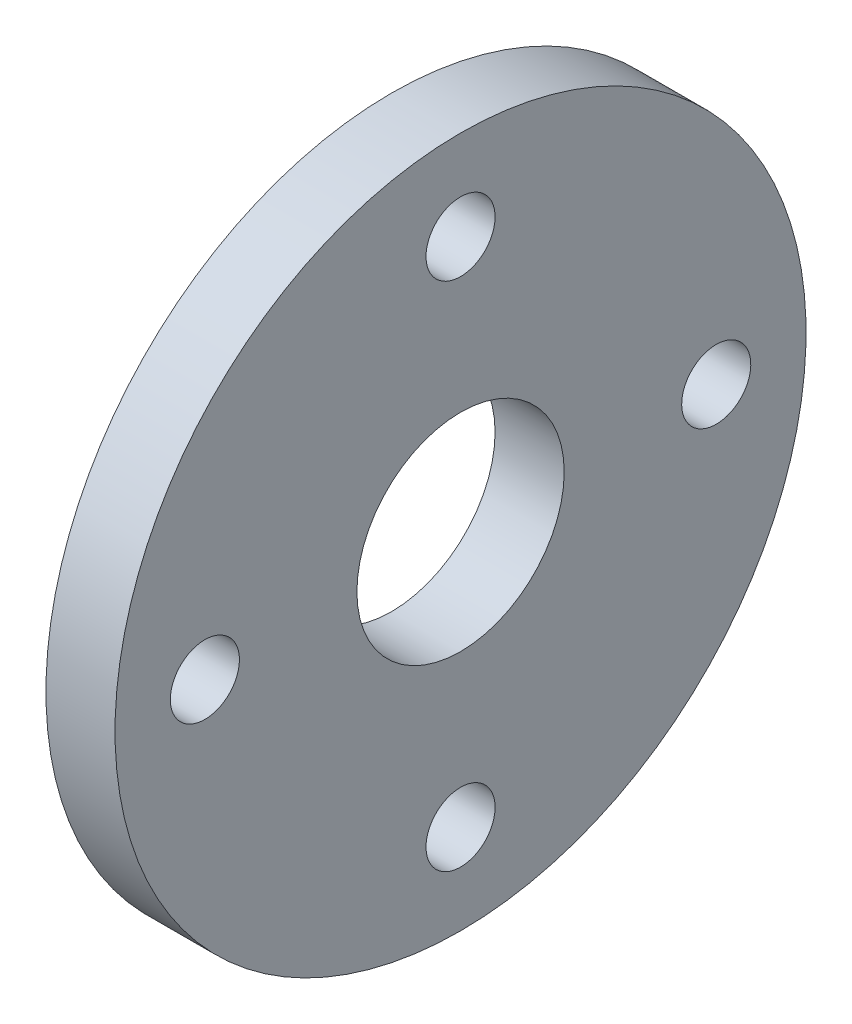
ISO-10303-21;
HEADER;
FILE_DESCRIPTION(('STEP AP214'),'2;1');
FILE_NAME('part.step','',(''),(''),'','','');
FILE_SCHEMA(('AUTOMOTIVE_DESIGN { 1 0 10303 214 1 1 1 1 }'));
ENDSEC;
DATA;
#1=APPLICATION_CONTEXT('core data for automotive mechanical design processes');
#2=APPLICATION_PROTOCOL_DEFINITION('international standard','automotive_design',2000,#1);
#3=PRODUCT_CONTEXT('',#1,'mechanical');
#4=PRODUCT('Part','Part','',(#3));
#5=PRODUCT_RELATED_PRODUCT_CATEGORY('part','',(#4));
#6=PRODUCT_DEFINITION_FORMATION('','',#4);
#7=PRODUCT_DEFINITION_CONTEXT('part definition',#1,'design');
#8=PRODUCT_DEFINITION('design','',#6,#7);
#9=PRODUCT_DEFINITION_SHAPE('','',#8);
#10=(LENGTH_UNIT() NAMED_UNIT(*) SI_UNIT(.MILLI.,.METRE.));
#11=(NAMED_UNIT(*) PLANE_ANGLE_UNIT() SI_UNIT($,.RADIAN.));
#12=(NAMED_UNIT(*) SI_UNIT($,.STERADIAN.) SOLID_ANGLE_UNIT());
#13=UNCERTAINTY_MEASURE_WITH_UNIT(LENGTH_MEASURE(1.E-05),#10,'distance_accuracy_value','');
#14=(GEOMETRIC_REPRESENTATION_CONTEXT(3) GLOBAL_UNCERTAINTY_ASSIGNED_CONTEXT((#13)) GLOBAL_UNIT_ASSIGNED_CONTEXT((#10,
#11,#12)) REPRESENTATION_CONTEXT('',''));
#15=CARTESIAN_POINT('',(0.,0.,0.));
#16=DIRECTION('',(0.,0.,1.));
#17=DIRECTION('',(1.,0.,0.));
#18=AXIS2_PLACEMENT_3D('',#15,#16,#17);
#19=CARTESIAN_POINT('',(192.5,139.,0.));
#20=DIRECTION('',(1.,0.,0.));
#21=DIRECTION('',(0.,1.,0.));
#22=AXIS2_PLACEMENT_3D('',#19,#20,#21);
#23=PLANE('',#22);
#24=CARTESIAN_POINT('',(192.5,102.,0.));
#25=DIRECTION('',(1.,0.,0.));
#26=DIRECTION('',(0.,1.,0.));
#27=AXIS2_PLACEMENT_3D('',#24,#25,#26);
#28=CIRCLE('',#27,5.);
#29=CARTESIAN_POINT('',(192.5,107.,0.));
#30=VERTEX_POINT('',#29);
#31=EDGE_CURVE('E78',#30,#30,#28,.T.);
#32=ORIENTED_EDGE('',*,*,#31,.F.);
#33=EDGE_LOOP('',(#32));
#34=FACE_BOUND('',#33,.T.);
#35=CARTESIAN_POINT('',(192.5,176.,0.));
#36=DIRECTION('',(1.,0.,0.));
#37=DIRECTION('',(0.,1.,0.));
#38=AXIS2_PLACEMENT_3D('',#35,#36,#37);
#39=CIRCLE('',#38,5.);
#40=CARTESIAN_POINT('',(192.5,181.,0.));
#41=VERTEX_POINT('',#40);
#42=EDGE_CURVE('E62',#41,#41,#39,.T.);
#43=ORIENTED_EDGE('',*,*,#42,.F.);
#44=EDGE_LOOP('',(#43));
#45=FACE_BOUND('',#44,.T.);
#46=CARTESIAN_POINT('',(192.5,139.,0.));
#47=DIRECTION('',(1.,0.,0.));
#48=DIRECTION('',(0.,1.,0.));
#49=AXIS2_PLACEMENT_3D('',#46,#47,#48);
#50=CIRCLE('',#49,50.);
#51=CARTESIAN_POINT('',(192.5,189.,0.));
#52=VERTEX_POINT('',#51);
#53=EDGE_CURVE('E10',#52,#52,#50,.T.);
#54=ORIENTED_EDGE('',*,*,#53,.T.);
#55=EDGE_LOOP('',(#54));
#56=FACE_BOUND('',#55,.T.);
#57=CARTESIAN_POINT('',(192.5,139.,37.));
#58=DIRECTION('',(1.,0.,0.));
#59=DIRECTION('',(0.,1.,0.));
#60=AXIS2_PLACEMENT_3D('',#57,#58,#59);
#61=CIRCLE('',#60,5.);
#62=CARTESIAN_POINT('',(192.5,144.,37.));
#63=VERTEX_POINT('',#62);
#64=EDGE_CURVE('E56',#63,#63,#61,.T.);
#65=ORIENTED_EDGE('',*,*,#64,.F.);
#66=EDGE_LOOP('',(#65));
#67=FACE_BOUND('',#66,.T.);
#68=CARTESIAN_POINT('',(192.5,139.,-37.));
#69=DIRECTION('',(1.,0.,0.));
#70=DIRECTION('',(0.,1.,0.));
#71=AXIS2_PLACEMENT_3D('',#68,#69,#70);
#72=CIRCLE('',#71,5.);
#73=CARTESIAN_POINT('',(192.5,144.,-37.));
#74=VERTEX_POINT('',#73);
#75=EDGE_CURVE('E70',#74,#74,#72,.T.);
#76=ORIENTED_EDGE('',*,*,#75,.F.);
#77=EDGE_LOOP('',(#76));
#78=FACE_BOUND('',#77,.T.);
#79=CARTESIAN_POINT('',(192.5,139.,0.));
#80=DIRECTION('',(1.,0.,0.));
#81=DIRECTION('',(0.,1.,0.));
#82=AXIS2_PLACEMENT_3D('',#79,#80,#81);
#83=CIRCLE('',#82,15.);
#84=CARTESIAN_POINT('',(192.5,154.,0.));
#85=VERTEX_POINT('',#84);
#86=EDGE_CURVE('E86',#85,#85,#83,.T.);
#87=ORIENTED_EDGE('',*,*,#86,.F.);
#88=EDGE_LOOP('',(#87));
#89=FACE_BOUND('',#88,.T.);
#90=ADVANCED_FACE('F43',(#34,#45,#56,#67,#78,#89),#23,.T.);
#91=CARTESIAN_POINT('',(182.5,139.,0.));
#92=DIRECTION('',(1.,0.,0.));
#93=DIRECTION('',(0.,1.,0.));
#94=AXIS2_PLACEMENT_3D('',#91,#92,#93);
#95=PLANE('',#94);
#96=CARTESIAN_POINT('',(182.5,139.,0.));
#97=DIRECTION('',(1.,0.,0.));
#98=DIRECTION('',(0.,1.,0.));
#99=AXIS2_PLACEMENT_3D('',#96,#97,#98);
#100=CIRCLE('',#99,50.);
#101=CARTESIAN_POINT('',(182.5,189.,0.));
#102=VERTEX_POINT('',#101);
#103=EDGE_CURVE('E47',#102,#102,#100,.T.);
#104=ORIENTED_EDGE('',*,*,#103,.F.);
#105=EDGE_LOOP('',(#104));
#106=FACE_BOUND('',#105,.T.);
#107=CARTESIAN_POINT('',(182.5,139.,37.));
#108=DIRECTION('',(1.,0.,0.));
#109=DIRECTION('',(0.,1.,0.));
#110=AXIS2_PLACEMENT_3D('',#107,#108,#109);
#111=CIRCLE('',#110,5.);
#112=CARTESIAN_POINT('',(182.5,144.,37.));
#113=VERTEX_POINT('',#112);
#114=EDGE_CURVE('E58',#113,#113,#111,.T.);
#115=ORIENTED_EDGE('',*,*,#114,.T.);
#116=EDGE_LOOP('',(#115));
#117=FACE_BOUND('',#116,.T.);
#118=CARTESIAN_POINT('',(182.5,176.,0.));
#119=DIRECTION('',(1.,0.,0.));
#120=DIRECTION('',(0.,1.,0.));
#121=AXIS2_PLACEMENT_3D('',#118,#119,#120);
#122=CIRCLE('',#121,5.);
#123=CARTESIAN_POINT('',(182.5,181.,0.));
#124=VERTEX_POINT('',#123);
#125=EDGE_CURVE('E66',#124,#124,#122,.T.);
#126=ORIENTED_EDGE('',*,*,#125,.T.);
#127=EDGE_LOOP('',(#126));
#128=FACE_BOUND('',#127,.T.);
#129=CARTESIAN_POINT('',(182.5,139.,-37.));
#130=DIRECTION('',(1.,0.,0.));
#131=DIRECTION('',(0.,1.,0.));
#132=AXIS2_PLACEMENT_3D('',#129,#130,#131);
#133=CIRCLE('',#132,5.);
#134=CARTESIAN_POINT('',(182.5,144.,-37.));
#135=VERTEX_POINT('',#134);
#136=EDGE_CURVE('E74',#135,#135,#133,.T.);
#137=ORIENTED_EDGE('',*,*,#136,.T.);
#138=EDGE_LOOP('',(#137));
#139=FACE_BOUND('',#138,.T.);
#140=CARTESIAN_POINT('',(182.5,102.,0.));
#141=DIRECTION('',(1.,0.,0.));
#142=DIRECTION('',(0.,1.,0.));
#143=AXIS2_PLACEMENT_3D('',#140,#141,#142);
#144=CIRCLE('',#143,5.);
#145=CARTESIAN_POINT('',(182.5,107.,0.));
#146=VERTEX_POINT('',#145);
#147=EDGE_CURVE('E82',#146,#146,#144,.T.);
#148=ORIENTED_EDGE('',*,*,#147,.T.);
#149=EDGE_LOOP('',(#148));
#150=FACE_BOUND('',#149,.T.);
#151=CARTESIAN_POINT('',(182.5,139.,0.));
#152=DIRECTION('',(1.,0.,0.));
#153=DIRECTION('',(0.,1.,0.));
#154=AXIS2_PLACEMENT_3D('',#151,#152,#153);
#155=CIRCLE('',#154,15.);
#156=CARTESIAN_POINT('',(182.5,154.,0.));
#157=VERTEX_POINT('',#156);
#158=EDGE_CURVE('E90',#157,#157,#155,.T.);
#159=ORIENTED_EDGE('',*,*,#158,.T.);
#160=EDGE_LOOP('',(#159));
#161=FACE_BOUND('',#160,.T.);
#162=ADVANCED_FACE('F102',(#106,#117,#128,#139,#150,#161),#95,.F.);
#163=CARTESIAN_POINT('',(192.5,139.,0.));
#164=DIRECTION('',(-1.,0.,0.));
#165=DIRECTION('',(0.,-1.,0.));
#166=AXIS2_PLACEMENT_3D('',#163,#164,#165);
#167=CYLINDRICAL_SURFACE('',#166,50.);
#168=ORIENTED_EDGE('',*,*,#53,.F.);
#169=EDGE_LOOP('',(#168));
#170=FACE_BOUND('',#169,.T.);
#171=ORIENTED_EDGE('',*,*,#103,.T.);
#172=EDGE_LOOP('',(#171));
#173=FACE_BOUND('',#172,.T.);
#174=ADVANCED_FACE('F45',(#170,#173),#167,.T.);
#175=CARTESIAN_POINT('',(192.5,139.,37.));
#176=DIRECTION('',(-1.,0.,0.));
#177=DIRECTION('',(0.,-1.,0.));
#178=AXIS2_PLACEMENT_3D('',#175,#176,#177);
#179=CYLINDRICAL_SURFACE('',#178,5.);
#180=ORIENTED_EDGE('',*,*,#64,.T.);
#181=EDGE_LOOP('',(#180));
#182=FACE_BOUND('',#181,.T.);
#183=ORIENTED_EDGE('',*,*,#114,.F.);
#184=EDGE_LOOP('',(#183));
#185=FACE_BOUND('',#184,.T.);
#186=ADVANCED_FACE('F112',(#182,#185),#179,.F.);
#187=CARTESIAN_POINT('',(192.5,176.,0.));
#188=DIRECTION('',(-1.,0.,0.));
#189=DIRECTION('',(0.,-1.,0.));
#190=AXIS2_PLACEMENT_3D('',#187,#188,#189);
#191=CYLINDRICAL_SURFACE('',#190,5.);
#192=ORIENTED_EDGE('',*,*,#42,.T.);
#193=EDGE_LOOP('',(#192));
#194=FACE_BOUND('',#193,.T.);
#195=ORIENTED_EDGE('',*,*,#125,.F.);
#196=EDGE_LOOP('',(#195));
#197=FACE_BOUND('',#196,.T.);
#198=ADVANCED_FACE('F115',(#194,#197),#191,.F.);
#199=CARTESIAN_POINT('',(192.5,139.,-37.));
#200=DIRECTION('',(-1.,0.,0.));
#201=DIRECTION('',(0.,-1.,0.));
#202=AXIS2_PLACEMENT_3D('',#199,#200,#201);
#203=CYLINDRICAL_SURFACE('',#202,5.);
#204=ORIENTED_EDGE('',*,*,#75,.T.);
#205=EDGE_LOOP('',(#204));
#206=FACE_BOUND('',#205,.T.);
#207=ORIENTED_EDGE('',*,*,#136,.F.);
#208=EDGE_LOOP('',(#207));
#209=FACE_BOUND('',#208,.T.);
#210=ADVANCED_FACE('F119',(#206,#209),#203,.F.);
#211=CARTESIAN_POINT('',(192.5,102.,0.));
#212=DIRECTION('',(-1.,0.,0.));
#213=DIRECTION('',(0.,-1.,0.));
#214=AXIS2_PLACEMENT_3D('',#211,#212,#213);
#215=CYLINDRICAL_SURFACE('',#214,5.);
#216=ORIENTED_EDGE('',*,*,#31,.T.);
#217=EDGE_LOOP('',(#216));
#218=FACE_BOUND('',#217,.T.);
#219=ORIENTED_EDGE('',*,*,#147,.F.);
#220=EDGE_LOOP('',(#219));
#221=FACE_BOUND('',#220,.T.);
#222=ADVANCED_FACE('F123',(#218,#221),#215,.F.);
#223=CARTESIAN_POINT('',(192.5,139.,0.));
#224=DIRECTION('',(-1.,0.,0.));
#225=DIRECTION('',(0.,-1.,0.));
#226=AXIS2_PLACEMENT_3D('',#223,#224,#225);
#227=CYLINDRICAL_SURFACE('',#226,15.);
#228=ORIENTED_EDGE('',*,*,#86,.T.);
#229=EDGE_LOOP('',(#228));
#230=FACE_BOUND('',#229,.T.);
#231=ORIENTED_EDGE('',*,*,#158,.F.);
#232=EDGE_LOOP('',(#231));
#233=FACE_BOUND('',#232,.T.);
#234=ADVANCED_FACE('F98',(#230,#233),#227,.F.);
#235=CLOSED_SHELL('',(#90,#162,#174,#186,#198,#210,#222,#234));
#236=MANIFOLD_SOLID_BREP('B2',#235);
#237=ADVANCED_BREP_SHAPE_REPRESENTATION('',(#18,#236),#14);
#238=SHAPE_DEFINITION_REPRESENTATION(#9,#237);
ENDSEC;
END-ISO-10303-21;
